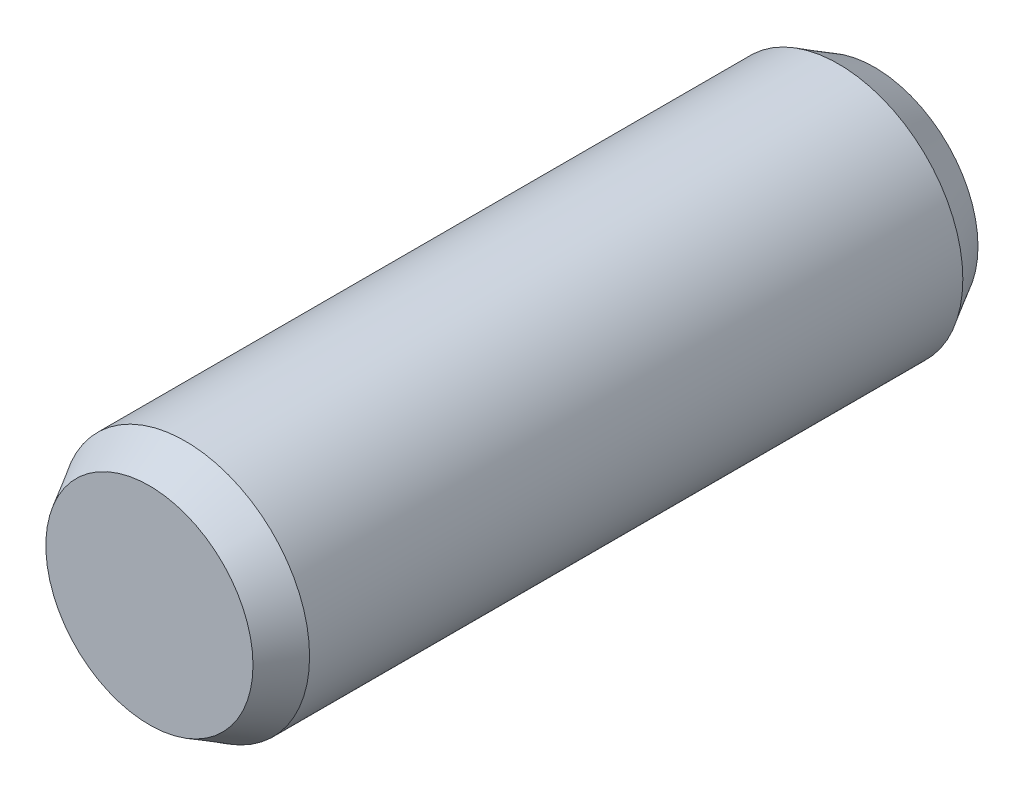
ISO-10303-21;
HEADER;
FILE_DESCRIPTION(('STEP AP214'),'2;1');
FILE_NAME('part.step','',(''),(''),'','','');
FILE_SCHEMA(('AUTOMOTIVE_DESIGN { 1 0 10303 214 1 1 1 1 }'));
ENDSEC;
DATA;
#1=APPLICATION_CONTEXT('core data for automotive mechanical design processes');
#2=APPLICATION_PROTOCOL_DEFINITION('international standard','automotive_design',2000,#1);
#3=PRODUCT_CONTEXT('',#1,'mechanical');
#4=PRODUCT('Part','Part','',(#3));
#5=PRODUCT_RELATED_PRODUCT_CATEGORY('part','',(#4));
#6=PRODUCT_DEFINITION_FORMATION('','',#4);
#7=PRODUCT_DEFINITION_CONTEXT('part definition',#1,'design');
#8=PRODUCT_DEFINITION('design','',#6,#7);
#9=PRODUCT_DEFINITION_SHAPE('','',#8);
#10=(LENGTH_UNIT() NAMED_UNIT(*) SI_UNIT(.MILLI.,.METRE.));
#11=(NAMED_UNIT(*) PLANE_ANGLE_UNIT() SI_UNIT($,.RADIAN.));
#12=(NAMED_UNIT(*) SI_UNIT($,.STERADIAN.) SOLID_ANGLE_UNIT());
#13=UNCERTAINTY_MEASURE_WITH_UNIT(LENGTH_MEASURE(1.E-05),#10,'distance_accuracy_value','');
#14=(GEOMETRIC_REPRESENTATION_CONTEXT(3) GLOBAL_UNCERTAINTY_ASSIGNED_CONTEXT((#13)) GLOBAL_UNIT_ASSIGNED_CONTEXT((#10,
#11,#12)) REPRESENTATION_CONTEXT('',''));
#15=CARTESIAN_POINT('',(0.,0.,0.));
#16=DIRECTION('',(0.,0.,1.));
#17=DIRECTION('',(1.,0.,0.));
#18=AXIS2_PLACEMENT_3D('',#15,#16,#17);
#19=CARTESIAN_POINT('',(0.,0.,17.5));
#20=DIRECTION('',(0.,0.,-1.));
#21=DIRECTION('',(-1.,0.,0.));
#22=AXIS2_PLACEMENT_3D('',#19,#20,#21);
#23=CYLINDRICAL_SURFACE('',#22,6.);
#24=CARTESIAN_POINT('',(0.,0.,15.7679491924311));
#25=DIRECTION('',(0.,0.,1.));
#26=DIRECTION('',(1.,0.,0.));
#27=AXIS2_PLACEMENT_3D('',#24,#25,#26);
#28=CIRCLE('',#27,6.);
#29=CARTESIAN_POINT('',(6.,0.,15.7679491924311));
#30=VERTEX_POINT('',#29);
#31=EDGE_CURVE('E10',#30,#30,#28,.F.);
#32=ORIENTED_EDGE('',*,*,#31,.T.);
#33=EDGE_LOOP('',(#32));
#34=FACE_BOUND('',#33,.T.);
#35=CARTESIAN_POINT('',(0.,0.,-15.7679491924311));
#36=DIRECTION('',(0.,0.,1.));
#37=DIRECTION('',(1.,0.,0.));
#38=AXIS2_PLACEMENT_3D('',#35,#36,#37);
#39=CIRCLE('',#38,6.);
#40=CARTESIAN_POINT('',(6.,0.,-15.7679491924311));
#41=VERTEX_POINT('',#40);
#42=EDGE_CURVE('E42',#41,#41,#39,.T.);
#43=ORIENTED_EDGE('',*,*,#42,.T.);
#44=EDGE_LOOP('',(#43));
#45=FACE_BOUND('',#44,.T.);
#46=ADVANCED_FACE('F28',(#34,#45),#23,.T.);
#47=CARTESIAN_POINT('',(0.,0.,17.5));
#48=DIRECTION('',(0.,0.,1.));
#49=DIRECTION('',(1.,0.,0.));
#50=AXIS2_PLACEMENT_3D('',#47,#48,#49);
#51=PLANE('',#50);
#52=CARTESIAN_POINT('',(0.,0.,17.5));
#53=DIRECTION('',(0.,0.,1.));
#54=DIRECTION('',(1.,0.,0.));
#55=AXIS2_PLACEMENT_3D('',#52,#53,#54);
#56=CIRCLE('',#55,5.);
#57=CARTESIAN_POINT('',(5.,0.,17.5));
#58=VERTEX_POINT('',#57);
#59=EDGE_CURVE('E34',#58,#58,#56,.T.);
#60=ORIENTED_EDGE('',*,*,#59,.T.);
#61=EDGE_LOOP('',(#60));
#62=FACE_BOUND('',#61,.T.);
#63=ADVANCED_FACE('F61',(#62),#51,.T.);
#64=CARTESIAN_POINT('',(0.,0.,-17.5));
#65=DIRECTION('',(0.,0.,1.));
#66=DIRECTION('',(1.,0.,0.));
#67=AXIS2_PLACEMENT_3D('',#64,#65,#66);
#68=PLANE('',#67);
#69=CARTESIAN_POINT('',(0.,0.,-17.5));
#70=DIRECTION('',(0.,0.,1.));
#71=DIRECTION('',(1.,0.,0.));
#72=AXIS2_PLACEMENT_3D('',#69,#70,#71);
#73=CIRCLE('',#72,4.99999999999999);
#74=CARTESIAN_POINT('',(4.99999999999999,0.,-17.5));
#75=VERTEX_POINT('',#74);
#76=EDGE_CURVE('E38',#75,#75,#73,.F.);
#77=ORIENTED_EDGE('',*,*,#76,.T.);
#78=EDGE_LOOP('',(#77));
#79=FACE_BOUND('',#78,.T.);
#80=ADVANCED_FACE('F52',(#79),#68,.F.);
#81=CARTESIAN_POINT('',(0.,0.,-15.7679491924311));
#82=DIRECTION('',(0.,0.,1.));
#83=DIRECTION('',(1.,0.,0.));
#84=AXIS2_PLACEMENT_3D('',#81,#82,#83);
#85=CONICAL_SURFACE('',#84,6.,0.523598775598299);
#86=ORIENTED_EDGE('',*,*,#76,.F.);
#87=EDGE_LOOP('',(#86));
#88=FACE_BOUND('',#87,.T.);
#89=ORIENTED_EDGE('',*,*,#42,.F.);
#90=EDGE_LOOP('',(#89));
#91=FACE_BOUND('',#90,.T.);
#92=ADVANCED_FACE('F49',(#88,#91),#85,.T.);
#93=CARTESIAN_POINT('',(0.,0.,17.5));
#94=DIRECTION('',(0.,0.,-1.));
#95=DIRECTION('',(-1.,0.,0.));
#96=AXIS2_PLACEMENT_3D('',#93,#94,#95);
#97=CONICAL_SURFACE('',#96,5.,0.5235987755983);
#98=ORIENTED_EDGE('',*,*,#31,.F.);
#99=EDGE_LOOP('',(#98));
#100=FACE_BOUND('',#99,.T.);
#101=ORIENTED_EDGE('',*,*,#59,.F.);
#102=EDGE_LOOP('',(#101));
#103=FACE_BOUND('',#102,.T.);
#104=ADVANCED_FACE('F51',(#100,#103),#97,.T.);
#105=CLOSED_SHELL('',(#46,#63,#80,#92,#104));
#106=MANIFOLD_SOLID_BREP('B2',#105);
#107=ADVANCED_BREP_SHAPE_REPRESENTATION('',(#18,#106),#14);
#108=SHAPE_DEFINITION_REPRESENTATION(#9,#107);
ENDSEC;
END-ISO-10303-21;
